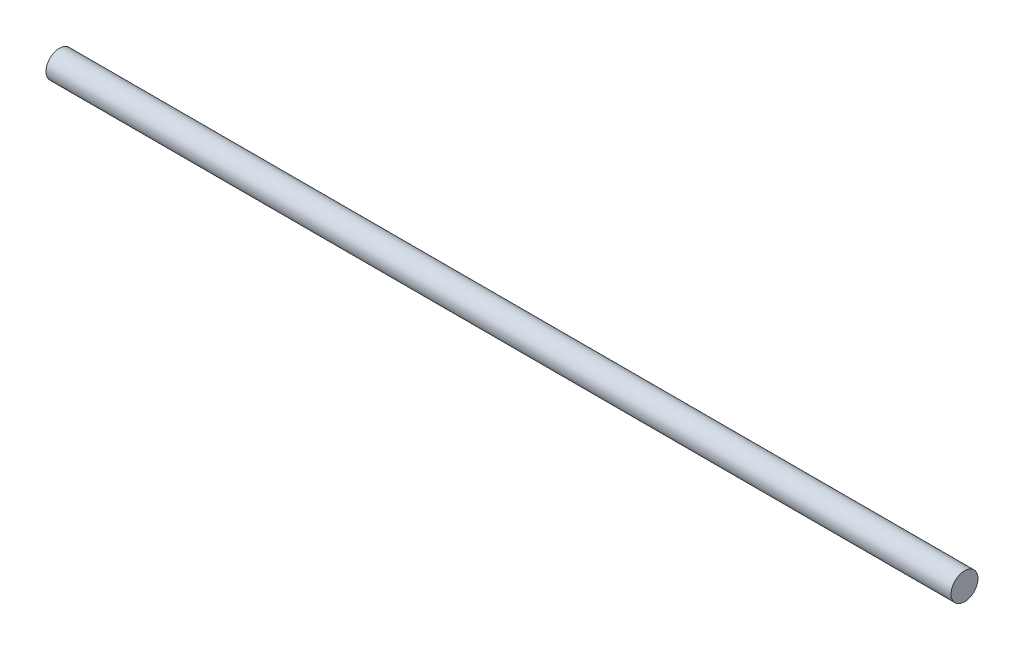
from build123d import *

# Parameters (mm, degrees)
CROQUIS1_R              = 5.95
SALIENTE_EXTRUIR1_DEPTH = 400


with BuildPart() as part:
    # Croquis1 → Saliente-Extruir1 (new body)
    with BuildSketch(Plane(origin=(0, 0, 0), x_dir=(0, 0, -1), z_dir=(1, 0, 0))):
        Circle(CROQUIS1_R)
    extrude(amount=SALIENTE_EXTRUIR1_DEPTH)


solid = part.part
